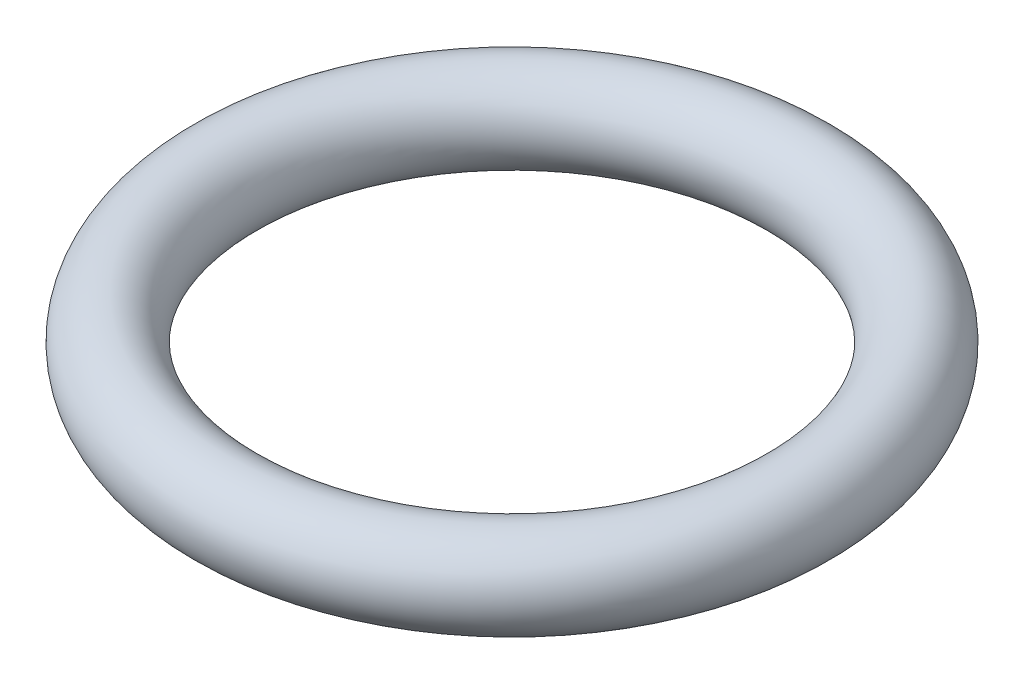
from build123d import *

# Parameters (mm, degrees)
SKETCH2_R = 0.9


with BuildPart() as part:
    # Sweep1: sweep along a path in Sketch1
    with BuildLine(Plane(origin=(0, 0, 0), x_dir=(1, 0, 0), z_dir=(0, 1, 0))) as sweep1_path:
        CenterArc((0, 0), 5, 0, 360)
    # Sketch2 → Sweep1 (sweep)
    with BuildSketch(Plane.XY):
        with Locations((-5.9, 0)):
            Circle(SKETCH2_R)
    sweep(path=sweep1_path.line)


solid = part.part
